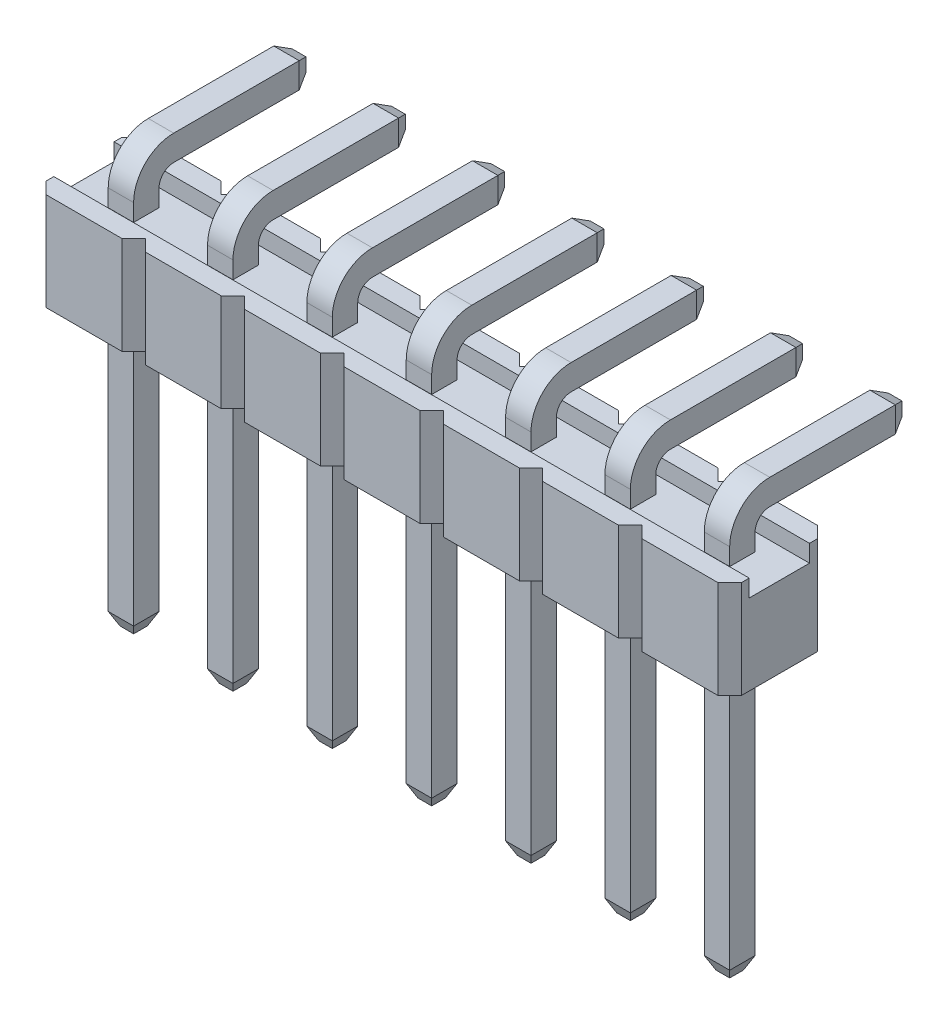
from build123d import *
from OCP.BRepFilletAPI import BRepFilletAPI_MakeChamfer

# Parameters (mm, degrees)
BASE_DEPTH                  = 2.5
LPATTERN1_COUNT             = 7
LPATTERN1_PITCH             = 2.54
CUT_DEPTH                   = 17.746432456
CUT_DEPTH_BACK              = 17.746432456
SKETCH2_W                   = 1.54
SKETCH2_H                   = 0.44
PIN_DEPTH                   = 0.325
CHAMFER1_SIZE               = 0.15
CHAMFER1_SIZE2              = 0.321676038
LPATTERN2_COUNT             = 7
LPATTERN2_PITCH             = 2.54
CHAMFER1_OF_LPATTERN2_SIZE  = 0.15
CHAMFER1_OF_LPATTERN2_SIZE2 = 0.321676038


with BuildPart() as part:
    # Sketch1 → Base (new body)
    with BuildSketch(Plane(origin=(0, 0, 0), x_dir=(1, 0, 0), z_dir=(0, 1, 0))):
        Polygon((-1.27, 0.97), (-0.97, 1.27), (0.97, 1.27), (1.27, 0.97), (1.27, -0.97), (0.97, -1.27), (-0.97, -1.27), (-1.27, -0.97), align=None)
    base = extrude(amount=-BASE_DEPTH)

    # LPattern1: Base ×7
    with Locations(*[(-i * LPATTERN1_PITCH, 0, 0) for i in range(1, LPATTERN1_COUNT)]):
        add(base)

    # Sketch2 → Cut (cut, two sides: drawn at the far end of the back side and taken through both)
    with BuildSketch(Plane(origin=(0, 0, 0), x_dir=(0, 0, -1), z_dir=(1, 0, 0)).offset(-CUT_DEPTH_BACK)):
        with Locations((0, -0.22)):
            Rectangle(SKETCH2_W, SKETCH2_H)
    extrude(amount=CUT_DEPTH + CUT_DEPTH_BACK, mode=Mode.SUBTRACT)

    # Sketch3 → Pin (add, symmetric)
    with BuildSketch(Plane(origin=(0, 0, 0), x_dir=(0, 0, -1), z_dir=(1, 0, 0))):
        with BuildLine():
            Line((0.325, -9.7), (0.325, 0))
            ThreePointArc((0.325, 0), (0.434834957, 0.265165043), (0.7, 0.375))
            Line((0.7, 0.375), (4.23, 0.375))
            Line((4.23, 0.375), (4.23, 1.025))
            Line((4.23, 1.025), (0.7, 1.025))
            ThreePointArc((0.7, 1.025), (-0.024784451, 0.724784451), (-0.325, 0))
            Line((-0.325, 0), (-0.325, -9.7))
            Line((-0.325, -9.7), (0.325, -9.7))
        make_face()
    pin = extrude(amount=PIN_DEPTH, both=True)

    # Chamfer1: one chamfer whose edges measure the first distance from different faces: ONE call of the kernel's chamfer builder (chamfer() names one face for all edges)
    chamfer1_edges_1 = [part.edges().sort_by_distance(p)[0] for p in [
        (-0.325, 0.7, -4.23),
        (0.325, 0.7, -4.23),
        (0, 0.375, -4.23),
        (0, 1.025, -4.23),
    ]]
    chamfer1_side_1 = [part.faces().sort_by_distance(p)[0] for p in [
        (0, 0.7, -4.23),
    ]]
    chamfer1_edges_2 = [part.edges().sort_by_distance(p)[0] for p in [
        (0.325, -9.7, 0),
        (0, -9.7, 0.325),
        (0, -9.7, -0.325),
        (-0.325, -9.7, 0),
    ]]
    chamfer1_side_2 = [part.faces().sort_by_distance(p)[0] for p in [
        (0, -9.7, 0),
    ]]
    chamfer1 = BRepFilletAPI_MakeChamfer(part.part.solid().wrapped)
    for e in chamfer1_edges_1:
        chamfer1.Add(CHAMFER1_SIZE, CHAMFER1_SIZE2, e.wrapped, chamfer1_side_1[0].wrapped)  # the first distance lies on this face
    for e in chamfer1_edges_2:
        chamfer1.Add(CHAMFER1_SIZE, CHAMFER1_SIZE2, e.wrapped, chamfer1_side_2[0].wrapped)  # the first distance lies on this face
    add(Compound.cast(chamfer1.Shape()), mode=Mode.REPLACE)

    # LPattern2: Pin ×7
    with Locations(*[(-i * LPATTERN2_PITCH, 0, 0) for i in range(1, LPATTERN2_COUNT)]):
        add(pin)

    # Chamfer1 of LPattern2: one chamfer whose edges measure the first distance from different faces: ONE call of the kernel's chamfer builder (chamfer() names one face for all edges)
    chamfer1_of_lpattern2_edges_1 = [part.edges().sort_by_distance(p)[0] for p in [
        (-2.865, 0.7, -4.23),
        (-2.215, 0.7, -4.23),
        (-2.54, 0.375, -4.23),
        (-2.54, 1.025, -4.23),
    ]]
    chamfer1_of_lpattern2_side_1 = [part.faces().sort_by_distance(p)[0] for p in [
        (-2.54, 0.7, -4.23),
    ]]
    chamfer1_of_lpattern2_edges_2 = [part.edges().sort_by_distance(p)[0] for p in [
        (-2.215, -9.7, 0),
        (-2.54, -9.7, 0.325),
        (-2.54, -9.7, -0.325),
        (-2.865, -9.7, 0),
    ]]
    chamfer1_of_lpattern2_side_2 = [part.faces().sort_by_distance(p)[0] for p in [
        (-2.54, -9.7, 0),
    ]]
    chamfer1_of_lpattern2_edges_3 = [part.edges().sort_by_distance(p)[0] for p in [
        (-5.405, 0.7, -4.23),
        (-4.755, 0.7, -4.23),
        (-5.08, 0.375, -4.23),
        (-5.08, 1.025, -4.23),
    ]]
    chamfer1_of_lpattern2_side_3 = [part.faces().sort_by_distance(p)[0] for p in [
        (-5.08, 0.7, -4.23),
    ]]
    chamfer1_of_lpattern2_edges_4 = [part.edges().sort_by_distance(p)[0] for p in [
        (-4.755, -9.7, 0),
        (-5.08, -9.7, 0.325),
        (-5.08, -9.7, -0.325),
        (-5.405, -9.7, 0),
    ]]
    chamfer1_of_lpattern2_side_4 = [part.faces().sort_by_distance(p)[0] for p in [
        (-5.08, -9.7, 0),
    ]]
    chamfer1_of_lpattern2_edges_5 = [part.edges().sort_by_distance(p)[0] for p in [
        (-7.945, 0.7, -4.23),
        (-7.295, 0.7, -4.23),
        (-7.62, 0.375, -4.23),
        (-7.62, 1.025, -4.23),
    ]]
    chamfer1_of_lpattern2_side_5 = [part.faces().sort_by_distance(p)[0] for p in [
        (-7.62, 0.7, -4.23),
    ]]
    chamfer1_of_lpattern2_edges_6 = [part.edges().sort_by_distance(p)[0] for p in [
        (-7.295, -9.7, 0),
        (-7.62, -9.7, 0.325),
        (-7.62, -9.7, -0.325),
        (-7.945, -9.7, 0),
    ]]
    chamfer1_of_lpattern2_side_6 = [part.faces().sort_by_distance(p)[0] for p in [
        (-7.62, -9.7, 0),
    ]]
    chamfer1_of_lpattern2_edges_7 = [part.edges().sort_by_distance(p)[0] for p in [
        (-10.485, 0.7, -4.23),
        (-9.835, 0.7, -4.23),
        (-10.16, 0.375, -4.23),
        (-10.16, 1.025, -4.23),
    ]]
    chamfer1_of_lpattern2_side_7 = [part.faces().sort_by_distance(p)[0] for p in [
        (-10.16, 0.7, -4.23),
    ]]
    chamfer1_of_lpattern2_edges_8 = [part.edges().sort_by_distance(p)[0] for p in [
        (-9.835, -9.7, 0),
        (-10.16, -9.7, 0.325),
        (-10.16, -9.7, -0.325),
        (-10.485, -9.7, 0),
    ]]
    chamfer1_of_lpattern2_side_8 = [part.faces().sort_by_distance(p)[0] for p in [
        (-10.16, -9.7, 0),
    ]]
    chamfer1_of_lpattern2_edges_9 = [part.edges().sort_by_distance(p)[0] for p in [
        (-13.025, 0.7, -4.23),
        (-12.375, 0.7, -4.23),
        (-12.7, 0.375, -4.23),
        (-12.7, 1.025, -4.23),
    ]]
    chamfer1_of_lpattern2_side_9 = [part.faces().sort_by_distance(p)[0] for p in [
        (-12.7, 0.7, -4.23),
    ]]
    chamfer1_of_lpattern2_edges_10 = [part.edges().sort_by_distance(p)[0] for p in [
        (-12.375, -9.7, 0),
        (-12.7, -9.7, 0.325),
        (-12.7, -9.7, -0.325),
        (-13.025, -9.7, 0),
    ]]
    chamfer1_of_lpattern2_side_10 = [part.faces().sort_by_distance(p)[0] for p in [
        (-12.7, -9.7, 0),
    ]]
    chamfer1_of_lpattern2_edges_11 = [part.edges().sort_by_distance(p)[0] for p in [
        (-15.565, 0.7, -4.23),
        (-14.915, 0.7, -4.23),
        (-15.24, 0.375, -4.23),
        (-15.24, 1.025, -4.23),
    ]]
    chamfer1_of_lpattern2_side_11 = [part.faces().sort_by_distance(p)[0] for p in [
        (-15.24, 0.7, -4.23),
    ]]
    chamfer1_of_lpattern2_edges_12 = [part.edges().sort_by_distance(p)[0] for p in [
        (-14.915, -9.7, 0),
        (-15.24, -9.7, 0.325),
        (-15.24, -9.7, -0.325),
        (-15.565, -9.7, 0),
    ]]
    chamfer1_of_lpattern2_side_12 = [part.faces().sort_by_distance(p)[0] for p in [
        (-15.24, -9.7, 0),
    ]]
    chamfer1_of_lpattern2 = BRepFilletAPI_MakeChamfer(part.part.solid().wrapped)
    for e in chamfer1_of_lpattern2_edges_1:
        chamfer1_of_lpattern2.Add(CHAMFER1_OF_LPATTERN2_SIZE, CHAMFER1_OF_LPATTERN2_SIZE2, e.wrapped, chamfer1_of_lpattern2_side_1[0].wrapped)  # the first distance lies on this face
    for e in chamfer1_of_lpattern2_edges_2:
        chamfer1_of_lpattern2.Add(CHAMFER1_OF_LPATTERN2_SIZE, CHAMFER1_OF_LPATTERN2_SIZE2, e.wrapped, chamfer1_of_lpattern2_side_2[0].wrapped)  # the first distance lies on this face
    for e in chamfer1_of_lpattern2_edges_3:
        chamfer1_of_lpattern2.Add(CHAMFER1_OF_LPATTERN2_SIZE, CHAMFER1_OF_LPATTERN2_SIZE2, e.wrapped, chamfer1_of_lpattern2_side_3[0].wrapped)  # the first distance lies on this face
    for e in chamfer1_of_lpattern2_edges_4:
        chamfer1_of_lpattern2.Add(CHAMFER1_OF_LPATTERN2_SIZE, CHAMFER1_OF_LPATTERN2_SIZE2, e.wrapped, chamfer1_of_lpattern2_side_4[0].wrapped)  # the first distance lies on this face
    for e in chamfer1_of_lpattern2_edges_5:
        chamfer1_of_lpattern2.Add(CHAMFER1_OF_LPATTERN2_SIZE, CHAMFER1_OF_LPATTERN2_SIZE2, e.wrapped, chamfer1_of_lpattern2_side_5[0].wrapped)  # the first distance lies on this face
    for e in chamfer1_of_lpattern2_edges_6:
        chamfer1_of_lpattern2.Add(CHAMFER1_OF_LPATTERN2_SIZE, CHAMFER1_OF_LPATTERN2_SIZE2, e.wrapped, chamfer1_of_lpattern2_side_6[0].wrapped)  # the first distance lies on this face
    for e in chamfer1_of_lpattern2_edges_7:
        chamfer1_of_lpattern2.Add(CHAMFER1_OF_LPATTERN2_SIZE, CHAMFER1_OF_LPATTERN2_SIZE2, e.wrapped, chamfer1_of_lpattern2_side_7[0].wrapped)  # the first distance lies on this face
    for e in chamfer1_of_lpattern2_edges_8:
        chamfer1_of_lpattern2.Add(CHAMFER1_OF_LPATTERN2_SIZE, CHAMFER1_OF_LPATTERN2_SIZE2, e.wrapped, chamfer1_of_lpattern2_side_8[0].wrapped)  # the first distance lies on this face
    for e in chamfer1_of_lpattern2_edges_9:
        chamfer1_of_lpattern2.Add(CHAMFER1_OF_LPATTERN2_SIZE, CHAMFER1_OF_LPATTERN2_SIZE2, e.wrapped, chamfer1_of_lpattern2_side_9[0].wrapped)  # the first distance lies on this face
    for e in chamfer1_of_lpattern2_edges_10:
        chamfer1_of_lpattern2.Add(CHAMFER1_OF_LPATTERN2_SIZE, CHAMFER1_OF_LPATTERN2_SIZE2, e.wrapped, chamfer1_of_lpattern2_side_10[0].wrapped)  # the first distance lies on this face
    for e in chamfer1_of_lpattern2_edges_11:
        chamfer1_of_lpattern2.Add(CHAMFER1_OF_LPATTERN2_SIZE, CHAMFER1_OF_LPATTERN2_SIZE2, e.wrapped, chamfer1_of_lpattern2_side_11[0].wrapped)  # the first distance lies on this face
    for e in chamfer1_of_lpattern2_edges_12:
        chamfer1_of_lpattern2.Add(CHAMFER1_OF_LPATTERN2_SIZE, CHAMFER1_OF_LPATTERN2_SIZE2, e.wrapped, chamfer1_of_lpattern2_side_12[0].wrapped)  # the first distance lies on this face
    add(Compound.cast(chamfer1_of_lpattern2.Shape()), mode=Mode.REPLACE)


solid = part.part
